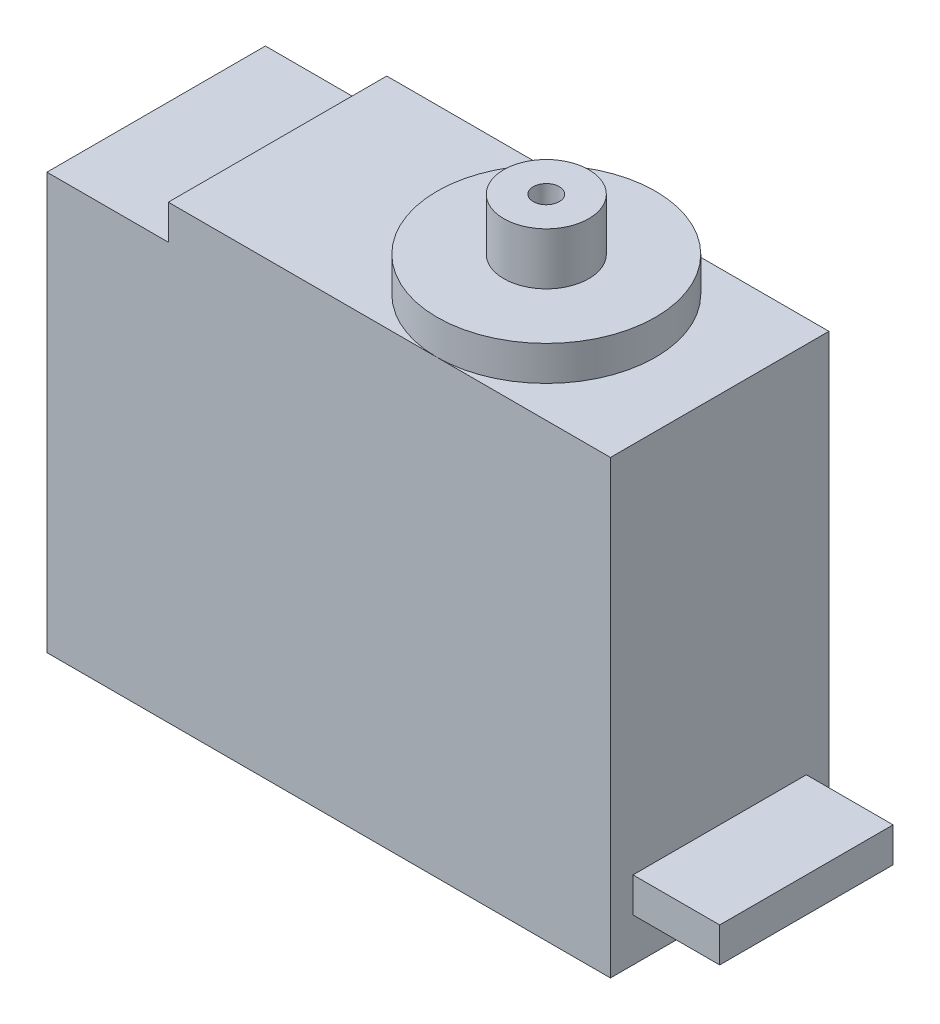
ISO-10303-21;
HEADER;
FILE_DESCRIPTION(('STEP AP214'),'2;1');
FILE_NAME('part.step','',(''),(''),'','','');
FILE_SCHEMA(('AUTOMOTIVE_DESIGN { 1 0 10303 214 1 1 1 1 }'));
ENDSEC;
DATA;
#1=APPLICATION_CONTEXT('core data for automotive mechanical design processes');
#2=APPLICATION_PROTOCOL_DEFINITION('international standard','automotive_design',2000,#1);
#3=PRODUCT_CONTEXT('',#1,'mechanical');
#4=PRODUCT('Part','Part','',(#3));
#5=PRODUCT_RELATED_PRODUCT_CATEGORY('part','',(#4));
#6=PRODUCT_DEFINITION_FORMATION('','',#4);
#7=PRODUCT_DEFINITION_CONTEXT('part definition',#1,'design');
#8=PRODUCT_DEFINITION('design','',#6,#7);
#9=PRODUCT_DEFINITION_SHAPE('','',#8);
#10=(LENGTH_UNIT() NAMED_UNIT(*) SI_UNIT(.MILLI.,.METRE.));
#11=(NAMED_UNIT(*) PLANE_ANGLE_UNIT() SI_UNIT($,.RADIAN.));
#12=(NAMED_UNIT(*) SI_UNIT($,.STERADIAN.) SOLID_ANGLE_UNIT());
#13=UNCERTAINTY_MEASURE_WITH_UNIT(LENGTH_MEASURE(1.E-05),#10,'distance_accuracy_value','');
#14=(GEOMETRIC_REPRESENTATION_CONTEXT(3) GLOBAL_UNCERTAINTY_ASSIGNED_CONTEXT((#13)) GLOBAL_UNIT_ASSIGNED_CONTEXT((#10,
#11,#12)) REPRESENTATION_CONTEXT('',''));
#15=CARTESIAN_POINT('',(0.,0.,0.));
#16=DIRECTION('',(0.,0.,1.));
#17=DIRECTION('',(1.,0.,0.));
#18=AXIS2_PLACEMENT_3D('',#15,#16,#17);
#19=CARTESIAN_POINT('',(0.,24.,0.));
#20=DIRECTION('',(-1.,0.,0.));
#21=DIRECTION('',(0.,0.,1.));
#22=AXIS2_PLACEMENT_3D('',#19,#20,#21);
#23=PLANE('',#22);
#24=DIRECTION('',(0.,0.,-1.));
#25=VECTOR('',#24,1.);
#26=CARTESIAN_POINT('',(0.,0.,0.));
#27=LINE('',#26,#25);
#28=CARTESIAN_POINT('',(0.,0.,0.));
#29=VERTEX_POINT('',#28);
#30=CARTESIAN_POINT('',(0.,0.,-12.6));
#31=VERTEX_POINT('',#30);
#32=EDGE_CURVE('E184',#29,#31,#27,.T.);
#33=ORIENTED_EDGE('',*,*,#32,.T.);
#34=DIRECTION('',(0.,-1.,0.));
#35=VECTOR('',#34,1.);
#36=CARTESIAN_POINT('',(0.,24.,-12.6));
#37=LINE('',#36,#35);
#38=CARTESIAN_POINT('',(0.,26.,-12.6));
#39=VERTEX_POINT('',#38);
#40=EDGE_CURVE('E40',#39,#31,#37,.T.);
#41=ORIENTED_EDGE('',*,*,#40,.F.);
#42=DIRECTION('',(0.,0.,-1.));
#43=VECTOR('',#42,1.);
#44=CARTESIAN_POINT('',(0.,26.,-12.6));
#45=LINE('',#44,#43);
#46=CARTESIAN_POINT('',(0.,26.,0.));
#47=VERTEX_POINT('',#46);
#48=EDGE_CURVE('E169',#47,#39,#45,.T.);
#49=ORIENTED_EDGE('',*,*,#48,.F.);
#50=DIRECTION('',(0.,-1.,0.));
#51=VECTOR('',#50,1.);
#52=CARTESIAN_POINT('',(0.,24.,0.));
#53=LINE('',#52,#51);
#54=EDGE_CURVE('E192',#47,#29,#53,.T.);
#55=ORIENTED_EDGE('',*,*,#54,.T.);
#56=EDGE_LOOP('',(#33,#41,#49,#55));
#57=FACE_BOUND('',#56,.T.);
#58=DIRECTION('',(0.,-1.,0.));
#59=VECTOR('',#58,1.);
#60=CARTESIAN_POINT('',(0.,2.5,-1.3));
#61=LINE('',#60,#59);
#62=CARTESIAN_POINT('',(0.,4.5,-1.3));
#63=VERTEX_POINT('',#62);
#64=CARTESIAN_POINT('',(0.,2.5,-1.3));
#65=VERTEX_POINT('',#64);
#66=EDGE_CURVE('E141',#63,#65,#61,.T.);
#67=ORIENTED_EDGE('',*,*,#66,.F.);
#68=DIRECTION('',(0.,0.,1.));
#69=VECTOR('',#68,1.);
#70=CARTESIAN_POINT('',(0.,4.5,-1.3));
#71=LINE('',#70,#69);
#72=CARTESIAN_POINT('',(0.,4.5,-11.3));
#73=VERTEX_POINT('',#72);
#74=EDGE_CURVE('E138',#73,#63,#71,.T.);
#75=ORIENTED_EDGE('',*,*,#74,.F.);
#76=DIRECTION('',(0.,1.,0.));
#77=VECTOR('',#76,1.);
#78=CARTESIAN_POINT('',(0.,2.5,-11.3));
#79=LINE('',#78,#77);
#80=CARTESIAN_POINT('',(0.,2.5,-11.3));
#81=VERTEX_POINT('',#80);
#82=EDGE_CURVE('E58',#81,#73,#79,.T.);
#83=ORIENTED_EDGE('',*,*,#82,.F.);
#84=DIRECTION('',(0.,0.,-1.));
#85=VECTOR('',#84,1.);
#86=CARTESIAN_POINT('',(0.,2.5,-1.3));
#87=LINE('',#86,#85);
#88=EDGE_CURVE('E53',#65,#81,#87,.T.);
#89=ORIENTED_EDGE('',*,*,#88,.F.);
#90=EDGE_LOOP('',(#67,#75,#83,#89));
#91=FACE_BOUND('',#90,.T.);
#92=ADVANCED_FACE('F37',(#57,#91),#23,.F.);
#93=CARTESIAN_POINT('',(0.,26.,0.));
#94=DIRECTION('',(0.,1.,0.));
#95=DIRECTION('',(0.,0.,1.));
#96=AXIS2_PLACEMENT_3D('',#93,#94,#95);
#97=PLANE('',#96);
#98=CARTESIAN_POINT('',(-10.,26.,-6.3));
#99=DIRECTION('',(0.,1.,0.));
#100=DIRECTION('',(0.,0.,1.));
#101=AXIS2_PLACEMENT_3D('',#98,#99,#100);
#102=CIRCLE('',#101,6.3);
#103=CARTESIAN_POINT('',(-10.,26.,0.));
#104=VERTEX_POINT('',#103);
#105=CARTESIAN_POINT('',(-10.,26.,-12.6));
#106=VERTEX_POINT('',#105);
#107=EDGE_CURVE('E155',#104,#106,#102,.T.);
#108=ORIENTED_EDGE('',*,*,#107,.F.);
#109=DIRECTION('',(1.,0.,0.));
#110=VECTOR('',#109,1.);
#111=CARTESIAN_POINT('',(-25.5,26.,0.));
#112=LINE('',#111,#110);
#113=EDGE_CURVE('E166',#104,#47,#112,.T.);
#114=ORIENTED_EDGE('',*,*,#113,.T.);
#115=ORIENTED_EDGE('',*,*,#48,.T.);
#116=DIRECTION('',(-1.,0.,0.));
#117=VECTOR('',#116,1.);
#118=CARTESIAN_POINT('',(-25.5,26.,-12.6));
#119=LINE('',#118,#117);
#120=EDGE_CURVE('E173',#39,#106,#119,.T.);
#121=ORIENTED_EDGE('',*,*,#120,.T.);
#122=EDGE_LOOP('',(#108,#114,#115,#121));
#123=FACE_BOUND('',#122,.T.);
#124=ADVANCED_FACE('F226',(#123),#97,.T.);
#125=CARTESIAN_POINT('',(0.,24.,-12.6));
#126=DIRECTION('',(0.,0.,1.));
#127=DIRECTION('',(1.,0.,0.));
#128=AXIS2_PLACEMENT_3D('',#125,#126,#127);
#129=PLANE('',#128);
#130=DIRECTION('',(-1.,0.,0.));
#131=VECTOR('',#130,1.);
#132=CARTESIAN_POINT('',(0.,0.,-12.6));
#133=LINE('',#132,#131);
#134=CARTESIAN_POINT('',(-32.5,0.,-12.6));
#135=VERTEX_POINT('',#134);
#136=EDGE_CURVE('E195',#31,#135,#133,.T.);
#137=ORIENTED_EDGE('',*,*,#136,.T.);
#138=DIRECTION('',(0.,-1.,0.));
#139=VECTOR('',#138,1.);
#140=CARTESIAN_POINT('',(-32.5,24.,-12.6));
#141=LINE('',#140,#139);
#142=CARTESIAN_POINT('',(-32.5,24.,-12.6));
#143=VERTEX_POINT('',#142);
#144=EDGE_CURVE('E204',#143,#135,#141,.T.);
#145=ORIENTED_EDGE('',*,*,#144,.F.);
#146=DIRECTION('',(-1.,0.,0.));
#147=VECTOR('',#146,1.);
#148=CARTESIAN_POINT('',(0.,24.,-12.6));
#149=LINE('',#148,#147);
#150=CARTESIAN_POINT('',(-25.5,24.,-12.6));
#151=VERTEX_POINT('',#150);
#152=EDGE_CURVE('E185',#151,#143,#149,.T.);
#153=ORIENTED_EDGE('',*,*,#152,.F.);
#154=DIRECTION('',(0.,-1.,0.));
#155=VECTOR('',#154,1.);
#156=CARTESIAN_POINT('',(-25.5,26.,-12.6));
#157=LINE('',#156,#155);
#158=CARTESIAN_POINT('',(-25.5,26.,-12.6));
#159=VERTEX_POINT('',#158);
#160=EDGE_CURVE('E176',#159,#151,#157,.T.);
#161=ORIENTED_EDGE('',*,*,#160,.F.);
#162=EDGE_CURVE('E172',#106,#159,#119,.T.);
#163=ORIENTED_EDGE('',*,*,#162,.F.);
#164=ORIENTED_EDGE('',*,*,#120,.F.);
#165=ORIENTED_EDGE('',*,*,#40,.T.);
#166=EDGE_LOOP('',(#137,#145,#153,#161,#163,#164,#165));
#167=FACE_BOUND('',#166,.T.);
#168=ADVANCED_FACE('F222',(#167),#129,.F.);
#169=CARTESIAN_POINT('',(-32.5,24.,0.));
#170=DIRECTION('',(1.,0.,0.));
#171=DIRECTION('',(0.,0.,-1.));
#172=AXIS2_PLACEMENT_3D('',#169,#170,#171);
#173=PLANE('',#172);
#174=DIRECTION('',(0.,0.,1.));
#175=VECTOR('',#174,1.);
#176=CARTESIAN_POINT('',(-32.5,0.,0.));
#177=LINE('',#176,#175);
#178=CARTESIAN_POINT('',(-32.5,0.,0.));
#179=VERTEX_POINT('',#178);
#180=EDGE_CURVE('E197',#135,#179,#177,.T.);
#181=ORIENTED_EDGE('',*,*,#180,.T.);
#182=DIRECTION('',(0.,-1.,0.));
#183=VECTOR('',#182,1.);
#184=CARTESIAN_POINT('',(-32.5,24.,0.));
#185=LINE('',#184,#183);
#186=CARTESIAN_POINT('',(-32.5,24.,0.));
#187=VERTEX_POINT('',#186);
#188=EDGE_CURVE('E202',#187,#179,#185,.T.);
#189=ORIENTED_EDGE('',*,*,#188,.F.);
#190=DIRECTION('',(0.,0.,1.));
#191=VECTOR('',#190,1.);
#192=CARTESIAN_POINT('',(-32.5,24.,0.));
#193=LINE('',#192,#191);
#194=EDGE_CURVE('E187',#143,#187,#193,.T.);
#195=ORIENTED_EDGE('',*,*,#194,.F.);
#196=ORIENTED_EDGE('',*,*,#144,.T.);
#197=EDGE_LOOP('',(#181,#189,#195,#196));
#198=FACE_BOUND('',#197,.T.);
#199=ADVANCED_FACE('F235',(#198),#173,.F.);
#200=CARTESIAN_POINT('',(0.,24.,0.));
#201=DIRECTION('',(0.,0.,-1.));
#202=DIRECTION('',(-1.,0.,0.));
#203=AXIS2_PLACEMENT_3D('',#200,#201,#202);
#204=PLANE('',#203);
#205=DIRECTION('',(1.,0.,0.));
#206=VECTOR('',#205,1.);
#207=CARTESIAN_POINT('',(0.,0.,0.));
#208=LINE('',#207,#206);
#209=EDGE_CURVE('E188',#179,#29,#208,.T.);
#210=ORIENTED_EDGE('',*,*,#209,.T.);
#211=ORIENTED_EDGE('',*,*,#54,.F.);
#212=ORIENTED_EDGE('',*,*,#113,.F.);
#213=CARTESIAN_POINT('',(-25.5,26.,0.));
#214=VERTEX_POINT('',#213);
#215=EDGE_CURVE('E167',#214,#104,#112,.T.);
#216=ORIENTED_EDGE('',*,*,#215,.F.);
#217=DIRECTION('',(0.,-1.,0.));
#218=VECTOR('',#217,1.);
#219=CARTESIAN_POINT('',(-25.5,26.,0.));
#220=LINE('',#219,#218);
#221=CARTESIAN_POINT('',(-25.5,24.,0.));
#222=VERTEX_POINT('',#221);
#223=EDGE_CURVE('E181',#214,#222,#220,.T.);
#224=ORIENTED_EDGE('',*,*,#223,.T.);
#225=DIRECTION('',(1.,0.,0.));
#226=VECTOR('',#225,1.);
#227=CARTESIAN_POINT('',(0.,24.,0.));
#228=LINE('',#227,#226);
#229=EDGE_CURVE('E190',#187,#222,#228,.T.);
#230=ORIENTED_EDGE('',*,*,#229,.F.);
#231=ORIENTED_EDGE('',*,*,#188,.T.);
#232=EDGE_LOOP('',(#210,#211,#212,#216,#224,#230,#231));
#233=FACE_BOUND('',#232,.T.);
#234=ADVANCED_FACE('F243',(#233),#204,.F.);
#235=CARTESIAN_POINT('',(0.,24.,0.));
#236=DIRECTION('',(0.,1.,0.));
#237=DIRECTION('',(0.,0.,1.));
#238=AXIS2_PLACEMENT_3D('',#235,#236,#237);
#239=PLANE('',#238);
#240=DIRECTION('',(0.,0.,1.));
#241=VECTOR('',#240,1.);
#242=CARTESIAN_POINT('',(-25.5,24.,-12.6));
#243=LINE('',#242,#241);
#244=EDGE_CURVE('E160',#151,#222,#243,.T.);
#245=ORIENTED_EDGE('',*,*,#244,.F.);
#246=ORIENTED_EDGE('',*,*,#152,.T.);
#247=ORIENTED_EDGE('',*,*,#194,.T.);
#248=ORIENTED_EDGE('',*,*,#229,.T.);
#249=EDGE_LOOP('',(#245,#246,#247,#248));
#250=FACE_BOUND('',#249,.T.);
#251=ADVANCED_FACE('F238',(#250),#239,.T.);
#252=CARTESIAN_POINT('',(0.,0.,0.));
#253=DIRECTION('',(0.,1.,0.));
#254=DIRECTION('',(0.,0.,1.));
#255=AXIS2_PLACEMENT_3D('',#252,#253,#254);
#256=PLANE('',#255);
#257=ORIENTED_EDGE('',*,*,#32,.F.);
#258=ORIENTED_EDGE('',*,*,#209,.F.);
#259=ORIENTED_EDGE('',*,*,#180,.F.);
#260=ORIENTED_EDGE('',*,*,#136,.F.);
#261=EDGE_LOOP('',(#257,#258,#259,#260));
#262=FACE_BOUND('',#261,.T.);
#263=ADVANCED_FACE('F233',(#262),#256,.F.);
#264=CARTESIAN_POINT('',(-25.5,26.,-12.6));
#265=DIRECTION('',(1.,0.,0.));
#266=DIRECTION('',(0.,0.,-1.));
#267=AXIS2_PLACEMENT_3D('',#264,#265,#266);
#268=PLANE('',#267);
#269=ORIENTED_EDGE('',*,*,#244,.T.);
#270=ORIENTED_EDGE('',*,*,#223,.F.);
#271=DIRECTION('',(0.,0.,1.));
#272=VECTOR('',#271,1.);
#273=CARTESIAN_POINT('',(-25.5,26.,-12.6));
#274=LINE('',#273,#272);
#275=EDGE_CURVE('E163',#159,#214,#274,.T.);
#276=ORIENTED_EDGE('',*,*,#275,.F.);
#277=ORIENTED_EDGE('',*,*,#160,.T.);
#278=EDGE_LOOP('',(#269,#270,#276,#277));
#279=FACE_BOUND('',#278,.T.);
#280=ADVANCED_FACE('F241',(#279),#268,.F.);
#281=EDGE_CURVE('E45',#106,#104,#102,.T.);
#282=ORIENTED_EDGE('',*,*,#281,.F.);
#283=ORIENTED_EDGE('',*,*,#162,.T.);
#284=ORIENTED_EDGE('',*,*,#275,.T.);
#285=ORIENTED_EDGE('',*,*,#215,.T.);
#286=EDGE_LOOP('',(#282,#283,#284,#285));
#287=FACE_BOUND('',#286,.T.);
#288=ADVANCED_FACE('F219',(#287),#97,.T.);
#289=CARTESIAN_POINT('',(-10.,28.,-6.3));
#290=DIRECTION('',(0.,-1.,0.));
#291=DIRECTION('',(0.,0.,-1.));
#292=AXIS2_PLACEMENT_3D('',#289,#290,#291);
#293=CYLINDRICAL_SURFACE('',#292,6.3);
#294=CARTESIAN_POINT('',(-10.,28.,-6.3));
#295=DIRECTION('',(0.,1.,0.));
#296=DIRECTION('',(0.,0.,1.));
#297=AXIS2_PLACEMENT_3D('',#294,#295,#296);
#298=CIRCLE('',#297,6.3);
#299=CARTESIAN_POINT('',(-10.,28.,0.));
#300=VERTEX_POINT('',#299);
#301=EDGE_CURVE('E157',#300,#300,#298,.T.);
#302=ORIENTED_EDGE('',*,*,#301,.F.);
#303=EDGE_LOOP('',(#302));
#304=FACE_BOUND('',#303,.T.);
#305=ORIENTED_EDGE('',*,*,#107,.T.);
#306=ORIENTED_EDGE('',*,*,#281,.T.);
#307=EDGE_LOOP('',(#305,#306));
#308=FACE_BOUND('',#307,.T.);
#309=ADVANCED_FACE('F215',(#304,#308),#293,.T.);
#310=CARTESIAN_POINT('',(-10.,28.,-6.3));
#311=DIRECTION('',(0.,1.,0.));
#312=DIRECTION('',(0.,0.,1.));
#313=AXIS2_PLACEMENT_3D('',#310,#311,#312);
#314=PLANE('',#313);
#315=CARTESIAN_POINT('',(-10.,28.,-6.3));
#316=DIRECTION('',(0.,1.,0.));
#317=DIRECTION('',(0.,0.,1.));
#318=AXIS2_PLACEMENT_3D('',#315,#316,#317);
#319=CIRCLE('',#318,2.45);
#320=CARTESIAN_POINT('',(-10.,28.,-3.85));
#321=VERTEX_POINT('',#320);
#322=EDGE_CURVE('E11',#321,#321,#319,.T.);
#323=ORIENTED_EDGE('',*,*,#322,.F.);
#324=EDGE_LOOP('',(#323));
#325=FACE_BOUND('',#324,.T.);
#326=ORIENTED_EDGE('',*,*,#301,.T.);
#327=EDGE_LOOP('',(#326));
#328=FACE_BOUND('',#327,.T.);
#329=ADVANCED_FACE('F268',(#325,#328),#314,.T.);
#330=CARTESIAN_POINT('',(-10.,31.,-6.3));
#331=DIRECTION('',(0.,-1.,0.));
#332=DIRECTION('',(0.,0.,-1.));
#333=AXIS2_PLACEMENT_3D('',#330,#331,#332);
#334=CYLINDRICAL_SURFACE('',#333,2.45);
#335=CARTESIAN_POINT('',(-10.,31.,-6.3));
#336=DIRECTION('',(0.,1.,0.));
#337=DIRECTION('',(0.,0.,1.));
#338=AXIS2_PLACEMENT_3D('',#335,#336,#337);
#339=CIRCLE('',#338,2.45);
#340=CARTESIAN_POINT('',(-10.,31.,-3.85));
#341=VERTEX_POINT('',#340);
#342=EDGE_CURVE('E152',#341,#341,#339,.T.);
#343=ORIENTED_EDGE('',*,*,#342,.F.);
#344=EDGE_LOOP('',(#343));
#345=FACE_BOUND('',#344,.T.);
#346=ORIENTED_EDGE('',*,*,#322,.T.);
#347=EDGE_LOOP('',(#346));
#348=FACE_BOUND('',#347,.T.);
#349=ADVANCED_FACE('F323',(#345,#348),#334,.T.);
#350=CARTESIAN_POINT('',(-10.,31.,-6.3));
#351=DIRECTION('',(0.,1.,0.));
#352=DIRECTION('',(0.,0.,1.));
#353=AXIS2_PLACEMENT_3D('',#350,#351,#352);
#354=PLANE('',#353);
#355=CARTESIAN_POINT('',(-10.,31.,-6.3));
#356=DIRECTION('',(0.,1.,0.));
#357=DIRECTION('',(0.,0.,1.));
#358=AXIS2_PLACEMENT_3D('',#355,#356,#357);
#359=CIRCLE('',#358,0.75);
#360=CARTESIAN_POINT('',(-10.,31.,-5.55));
#361=VERTEX_POINT('',#360);
#362=EDGE_CURVE('E142',#361,#361,#359,.T.);
#363=ORIENTED_EDGE('',*,*,#362,.F.);
#364=EDGE_LOOP('',(#363));
#365=FACE_BOUND('',#364,.T.);
#366=ORIENTED_EDGE('',*,*,#342,.T.);
#367=EDGE_LOOP('',(#366));
#368=FACE_BOUND('',#367,.T.);
#369=ADVANCED_FACE('F334',(#365,#368),#354,.T.);
#370=CARTESIAN_POINT('',(-10.,28.,-6.3));
#371=DIRECTION('',(0.,1.,0.));
#372=DIRECTION('',(0.,0.,1.));
#373=AXIS2_PLACEMENT_3D('',#370,#371,#372);
#374=CYLINDRICAL_SURFACE('',#373,0.75);
#375=CARTESIAN_POINT('',(-10.,28.,-6.3));
#376=DIRECTION('',(0.,1.,0.));
#377=DIRECTION('',(0.,0.,1.));
#378=AXIS2_PLACEMENT_3D('',#375,#376,#377);
#379=CIRCLE('',#378,0.75);
#380=CARTESIAN_POINT('',(-10.,28.,-5.55));
#381=VERTEX_POINT('',#380);
#382=EDGE_CURVE('E145',#381,#381,#379,.T.);
#383=ORIENTED_EDGE('',*,*,#382,.F.);
#384=EDGE_LOOP('',(#383));
#385=FACE_BOUND('',#384,.T.);
#386=ORIENTED_EDGE('',*,*,#362,.T.);
#387=EDGE_LOOP('',(#386));
#388=FACE_BOUND('',#387,.T.);
#389=ADVANCED_FACE('F345',(#385,#388),#374,.F.);
#390=CARTESIAN_POINT('',(-10.,28.,-6.3));
#391=DIRECTION('',(0.,1.,0.));
#392=DIRECTION('',(0.,0.,1.));
#393=AXIS2_PLACEMENT_3D('',#390,#391,#392);
#394=PLANE('',#393);
#395=ORIENTED_EDGE('',*,*,#382,.T.);
#396=EDGE_LOOP('',(#395));
#397=FACE_BOUND('',#396,.T.);
#398=ADVANCED_FACE('F356',(#397),#394,.T.);
#399=CARTESIAN_POINT('',(5.,2.5,-1.3));
#400=DIRECTION('',(0.,0.,-1.));
#401=DIRECTION('',(-1.,0.,0.));
#402=AXIS2_PLACEMENT_3D('',#399,#400,#401);
#403=PLANE('',#402);
#404=ORIENTED_EDGE('',*,*,#66,.T.);
#405=DIRECTION('',(-1.,0.,0.));
#406=VECTOR('',#405,1.);
#407=CARTESIAN_POINT('',(5.,2.5,-1.3));
#408=LINE('',#407,#406);
#409=CARTESIAN_POINT('',(5.,2.5,-1.3));
#410=VERTEX_POINT('',#409);
#411=EDGE_CURVE('E122',#410,#65,#408,.T.);
#412=ORIENTED_EDGE('',*,*,#411,.F.);
#413=DIRECTION('',(0.,-1.,0.));
#414=VECTOR('',#413,1.);
#415=CARTESIAN_POINT('',(5.,2.5,-1.3));
#416=LINE('',#415,#414);
#417=CARTESIAN_POINT('',(5.,4.5,-1.3));
#418=VERTEX_POINT('',#417);
#419=EDGE_CURVE('E129',#418,#410,#416,.T.);
#420=ORIENTED_EDGE('',*,*,#419,.F.);
#421=DIRECTION('',(-1.,0.,0.));
#422=VECTOR('',#421,1.);
#423=CARTESIAN_POINT('',(5.,4.5,-1.3));
#424=LINE('',#423,#422);
#425=EDGE_CURVE('E433',#418,#63,#424,.T.);
#426=ORIENTED_EDGE('',*,*,#425,.T.);
#427=EDGE_LOOP('',(#404,#412,#420,#426));
#428=FACE_BOUND('',#427,.T.);
#429=ADVANCED_FACE('F140',(#428),#403,.F.);
#430=CARTESIAN_POINT('',(5.,2.5,-1.3));
#431=DIRECTION('',(0.,1.,0.));
#432=DIRECTION('',(0.,0.,1.));
#433=AXIS2_PLACEMENT_3D('',#430,#431,#432);
#434=PLANE('',#433);
#435=ORIENTED_EDGE('',*,*,#88,.T.);
#436=DIRECTION('',(-1.,0.,0.));
#437=VECTOR('',#436,1.);
#438=CARTESIAN_POINT('',(5.,2.5,-11.3));
#439=LINE('',#438,#437);
#440=CARTESIAN_POINT('',(5.,2.5,-11.3));
#441=VERTEX_POINT('',#440);
#442=EDGE_CURVE('E125',#441,#81,#439,.T.);
#443=ORIENTED_EDGE('',*,*,#442,.F.);
#444=DIRECTION('',(0.,0.,-1.));
#445=VECTOR('',#444,1.);
#446=CARTESIAN_POINT('',(5.,2.5,-1.3));
#447=LINE('',#446,#445);
#448=EDGE_CURVE('E118',#410,#441,#447,.T.);
#449=ORIENTED_EDGE('',*,*,#448,.F.);
#450=ORIENTED_EDGE('',*,*,#411,.T.);
#451=EDGE_LOOP('',(#435,#443,#449,#450));
#452=FACE_BOUND('',#451,.T.);
#453=ADVANCED_FACE('F120',(#452),#434,.F.);
#454=CARTESIAN_POINT('',(5.,2.5,-11.3));
#455=DIRECTION('',(0.,0.,1.));
#456=DIRECTION('',(1.,0.,0.));
#457=AXIS2_PLACEMENT_3D('',#454,#455,#456);
#458=PLANE('',#457);
#459=ORIENTED_EDGE('',*,*,#82,.T.);
#460=DIRECTION('',(-1.,0.,0.));
#461=VECTOR('',#460,1.);
#462=CARTESIAN_POINT('',(5.,4.5,-11.3));
#463=LINE('',#462,#461);
#464=CARTESIAN_POINT('',(5.,4.5,-11.3));
#465=VERTEX_POINT('',#464);
#466=EDGE_CURVE('E147',#465,#73,#463,.T.);
#467=ORIENTED_EDGE('',*,*,#466,.F.);
#468=DIRECTION('',(0.,1.,0.));
#469=VECTOR('',#468,1.);
#470=CARTESIAN_POINT('',(5.,2.5,-11.3));
#471=LINE('',#470,#469);
#472=EDGE_CURVE('E128',#441,#465,#471,.T.);
#473=ORIENTED_EDGE('',*,*,#472,.F.);
#474=ORIENTED_EDGE('',*,*,#442,.T.);
#475=EDGE_LOOP('',(#459,#467,#473,#474));
#476=FACE_BOUND('',#475,.T.);
#477=ADVANCED_FACE('F391',(#476),#458,.F.);
#478=CARTESIAN_POINT('',(5.,4.5,-1.3));
#479=DIRECTION('',(0.,-1.,0.));
#480=DIRECTION('',(0.,0.,-1.));
#481=AXIS2_PLACEMENT_3D('',#478,#479,#480);
#482=PLANE('',#481);
#483=ORIENTED_EDGE('',*,*,#74,.T.);
#484=ORIENTED_EDGE('',*,*,#425,.F.);
#485=DIRECTION('',(0.,0.,1.));
#486=VECTOR('',#485,1.);
#487=CARTESIAN_POINT('',(5.,4.5,-1.3));
#488=LINE('',#487,#486);
#489=EDGE_CURVE('E134',#465,#418,#488,.T.);
#490=ORIENTED_EDGE('',*,*,#489,.F.);
#491=ORIENTED_EDGE('',*,*,#466,.T.);
#492=EDGE_LOOP('',(#483,#484,#490,#491));
#493=FACE_BOUND('',#492,.T.);
#494=ADVANCED_FACE('F401',(#493),#482,.F.);
#495=CARTESIAN_POINT('',(5.,0.,0.));
#496=DIRECTION('',(-1.,0.,0.));
#497=DIRECTION('',(0.,0.,1.));
#498=AXIS2_PLACEMENT_3D('',#495,#496,#497);
#499=PLANE('',#498);
#500=ORIENTED_EDGE('',*,*,#419,.T.);
#501=ORIENTED_EDGE('',*,*,#448,.T.);
#502=ORIENTED_EDGE('',*,*,#472,.T.);
#503=ORIENTED_EDGE('',*,*,#489,.T.);
#504=EDGE_LOOP('',(#500,#501,#502,#503));
#505=FACE_BOUND('',#504,.T.);
#506=ADVANCED_FACE('F132',(#505),#499,.F.);
#507=CLOSED_SHELL('',(#92,#124,#168,#199,#234,#251,#263,#280,#288,#309,#329,#349,#369,#389,#398,
#429,#453,#477,#494,#506));
#508=MANIFOLD_SOLID_BREP('B2',#507);
#509=ADVANCED_BREP_SHAPE_REPRESENTATION('',(#18,#508),#14);
#510=SHAPE_DEFINITION_REPRESENTATION(#9,#509);
ENDSEC;
END-ISO-10303-21;
